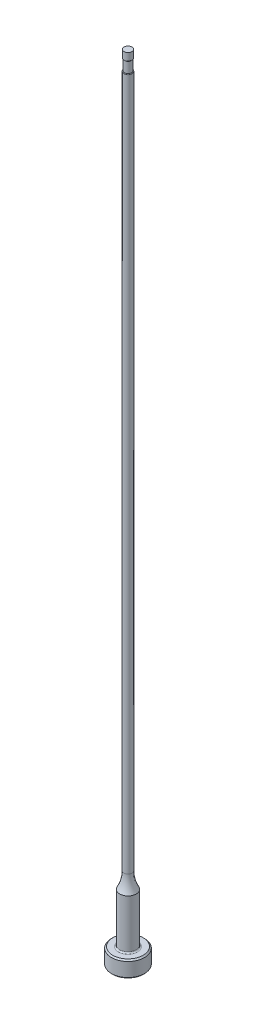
ISO-10303-21;
HEADER;
FILE_DESCRIPTION(('STEP AP214'),'2;1');
FILE_NAME('part.step','',(''),(''),'','','');
FILE_SCHEMA(('AUTOMOTIVE_DESIGN { 1 0 10303 214 1 1 1 1 }'));
ENDSEC;
DATA;
#1=APPLICATION_CONTEXT('core data for automotive mechanical design processes');
#2=APPLICATION_PROTOCOL_DEFINITION('international standard','automotive_design',2000,#1);
#3=PRODUCT_CONTEXT('',#1,'mechanical');
#4=PRODUCT('Part','Part','',(#3));
#5=PRODUCT_RELATED_PRODUCT_CATEGORY('part','',(#4));
#6=PRODUCT_DEFINITION_FORMATION('','',#4);
#7=PRODUCT_DEFINITION_CONTEXT('part definition',#1,'design');
#8=PRODUCT_DEFINITION('design','',#6,#7);
#9=PRODUCT_DEFINITION_SHAPE('','',#8);
#10=(LENGTH_UNIT() NAMED_UNIT(*) SI_UNIT(.MILLI.,.METRE.));
#11=(NAMED_UNIT(*) PLANE_ANGLE_UNIT() SI_UNIT($,.RADIAN.));
#12=(NAMED_UNIT(*) SI_UNIT($,.STERADIAN.) SOLID_ANGLE_UNIT());
#13=UNCERTAINTY_MEASURE_WITH_UNIT(LENGTH_MEASURE(1.E-05),#10,'distance_accuracy_value','');
#14=(GEOMETRIC_REPRESENTATION_CONTEXT(3) GLOBAL_UNCERTAINTY_ASSIGNED_CONTEXT((#13)) GLOBAL_UNIT_ASSIGNED_CONTEXT((#10,
#11,#12)) REPRESENTATION_CONTEXT('',''));
#15=CARTESIAN_POINT('',(0.,0.,0.));
#16=DIRECTION('',(0.,0.,1.));
#17=DIRECTION('',(1.,0.,0.));
#18=AXIS2_PLACEMENT_3D('',#15,#16,#17);
#19=CARTESIAN_POINT('',(0.,259.958771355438,0.));
#20=DIRECTION('',(0.,1.,0.));
#21=DIRECTION('',(0.,0.,1.));
#22=AXIS2_PLACEMENT_3D('',#19,#20,#21);
#23=CYLINDRICAL_SURFACE('',#22,0.79374999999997);
#24=DIRECTION('',(0.,1.,0.));
#25=VECTOR('',#24,1.);
#26=CARTESIAN_POINT('',(-0.692149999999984,259.958771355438,-0.388545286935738));
#27=LINE('',#26,#25);
#28=CARTESIAN_POINT('',(-0.692149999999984,148.719565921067,-0.388545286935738));
#29=VERTEX_POINT('',#28);
#30=CARTESIAN_POINT('',(-0.692149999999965,111.76,-0.388545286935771));
#31=VERTEX_POINT('',#30);
#32=EDGE_CURVE('E66',#29,#31,#27,.F.);
#33=ORIENTED_EDGE('',*,*,#32,.F.);
#34=CARTESIAN_POINT('',(0.,148.719565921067,0.));
#35=DIRECTION('',(0.,1.,0.));
#36=DIRECTION('',(0.,0.,1.));
#37=AXIS2_PLACEMENT_3D('',#34,#35,#36);
#38=CIRCLE('',#37,0.79374999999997);
#39=CARTESIAN_POINT('',(-0.692149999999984,148.719565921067,0.388545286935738));
#40=VERTEX_POINT('',#39);
#41=EDGE_CURVE('E44',#29,#40,#38,.F.);
#42=ORIENTED_EDGE('',*,*,#41,.T.);
#43=DIRECTION('',(0.,1.,0.));
#44=VECTOR('',#43,1.);
#45=CARTESIAN_POINT('',(-0.692149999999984,259.958771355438,0.388545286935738));
#46=LINE('',#45,#44);
#47=CARTESIAN_POINT('',(-0.692149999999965,111.76,0.388545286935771));
#48=VERTEX_POINT('',#47);
#49=EDGE_CURVE('E72',#48,#40,#46,.T.);
#50=ORIENTED_EDGE('',*,*,#49,.F.);
#51=CARTESIAN_POINT('',(-0.692149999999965,111.76,-0.388545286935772));
#52=CARTESIAN_POINT('',(-0.692147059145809,111.726595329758,-0.388529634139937));
#53=CARTESIAN_POINT('',(-0.692677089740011,111.693184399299,-0.387605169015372));
#54=CARTESIAN_POINT('',(-0.694785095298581,111.626441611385,-0.383825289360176));
#55=CARTESIAN_POINT('',(-0.696365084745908,111.593110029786,-0.380966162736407));
#56=CARTESIAN_POINT('',(-0.700560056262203,111.526665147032,-0.373193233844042));
#57=CARTESIAN_POINT('',(-0.703177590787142,111.493552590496,-0.368274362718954));
#58=CARTESIAN_POINT('',(-0.70939790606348,111.427866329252,-0.356147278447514));
#59=CARTESIAN_POINT('',(-0.712999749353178,111.395292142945,-0.348941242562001));
#60=CARTESIAN_POINT('',(-0.720516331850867,111.335629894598,-0.333107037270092));
#61=CARTESIAN_POINT('',(-0.724309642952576,111.308432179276,-0.324837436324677));
#62=CARTESIAN_POINT('',(-0.732469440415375,111.254890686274,-0.305996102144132));
#63=CARTESIAN_POINT('',(-0.736836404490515,111.228547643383,-0.295422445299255));
#64=CARTESIAN_POINT('',(-0.746025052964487,111.176994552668,-0.271391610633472));
#65=CARTESIAN_POINT('',(-0.75085027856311,111.151796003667,-0.257910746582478));
#66=CARTESIAN_POINT('',(-0.760636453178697,111.103650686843,-0.227438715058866));
#67=CARTESIAN_POINT('',(-0.765596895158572,111.080696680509,-0.210459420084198));
#68=CARTESIAN_POINT('',(-0.772863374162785,111.048559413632,-0.181185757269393));
#69=CARTESIAN_POINT('',(-0.775317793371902,111.037987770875,-0.170459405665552));
#70=CARTESIAN_POINT('',(-0.779981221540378,111.018302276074,-0.147661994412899));
#71=CARTESIAN_POINT('',(-0.782190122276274,111.009189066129,-0.135590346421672));
#72=CARTESIAN_POINT('',(-0.786212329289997,110.99284932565,-0.10990918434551));
#73=CARTESIAN_POINT('',(-0.788019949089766,110.985649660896,-0.0962812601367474));
#74=CARTESIAN_POINT('',(-0.790974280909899,110.973994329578,-0.0678329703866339));
#75=CARTESIAN_POINT('',(-0.792122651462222,110.969531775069,-0.0530157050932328));
#76=CARTESIAN_POINT('',(-0.793477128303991,110.964282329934,-0.0246588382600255));
#77=CARTESIAN_POINT('',(-0.793785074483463,110.963097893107,-0.0111986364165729));
#78=CARTESIAN_POINT('',(-0.793708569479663,110.963392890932,0.0156909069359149));
#79=CARTESIAN_POINT('',(-0.793324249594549,110.964871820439,0.0291202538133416));
#80=CARTESIAN_POINT('',(-0.792034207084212,110.969877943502,0.0533347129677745));
#81=CARTESIAN_POINT('',(-0.791220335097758,110.973045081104,0.064202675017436));
#82=CARTESIAN_POINT('',(-0.789221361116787,110.980900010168,0.0853309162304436));
#83=CARTESIAN_POINT('',(-0.78803617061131,110.985588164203,0.0955910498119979));
#84=CARTESIAN_POINT('',(-0.784691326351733,110.998986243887,0.120537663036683));
#85=CARTESIAN_POINT('',(-0.782345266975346,111.008520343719,0.134755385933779));
#86=CARTESIAN_POINT('',(-0.777271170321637,111.029662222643,0.161475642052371));
#87=CARTESIAN_POINT('',(-0.774542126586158,111.041275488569,0.173973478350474));
#88=CARTESIAN_POINT('',(-0.76709792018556,111.073902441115,0.204925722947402));
#89=CARTESIAN_POINT('',(-0.762235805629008,111.096152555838,0.222031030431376));
#90=CARTESIAN_POINT('',(-0.752599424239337,111.142926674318,0.252764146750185));
#91=CARTESIAN_POINT('',(-0.747825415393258,111.167456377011,0.26638290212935));
#92=CARTESIAN_POINT('',(-0.734693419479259,111.239796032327,0.30145019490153));
#93=CARTESIAN_POINT('',(-0.726816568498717,111.289351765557,0.319450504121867));
#94=CARTESIAN_POINT('',(-0.713277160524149,111.390727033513,0.348596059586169));
#95=CARTESIAN_POINT('',(-0.707621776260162,111.442553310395,0.359719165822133));
#96=CARTESIAN_POINT('',(-0.699557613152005,111.538820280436,0.375130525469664));
#97=CARTESIAN_POINT('',(-0.696772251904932,111.583103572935,0.380231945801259));
#98=CARTESIAN_POINT('',(-0.693072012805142,111.671601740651,0.386898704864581));
#99=CARTESIAN_POINT('',(-0.692139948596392,111.715813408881,0.388496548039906));
#100=CARTESIAN_POINT('',(-0.692149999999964,111.76,0.388545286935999));
#101=B_SPLINE_CURVE_WITH_KNOTS('',3,(#51,#52,#53,#54,#55,#56,#57,#58,#59,#60,#61,#62,#63,#64,
#65,#66,#67,#68,#69,#70,#71,#72,#73,#74,#75,#76,#77,#78,#79,#80,#81,#82,#83,#84,#85,#86,#87,#88,
#89,#90,#91,#92,#93,#94,#95,#96,#97,#98,#99,#100),.UNSPECIFIED.,.F.,.F.,(4,2,2,2,2,2,2,2,2,2,2,
2,2,2,2,2,2,2,2,2,2,2,2,2,4),(0.,0.100207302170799,0.20060742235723,0.30125608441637,
0.401809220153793,0.487757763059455,0.573778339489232,0.660528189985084,0.746988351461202,
0.792665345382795,0.838362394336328,0.884670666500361,0.930861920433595,0.971137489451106,
1.01140542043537,1.04531885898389,1.0792403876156,1.13077999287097,1.1824576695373,
1.26742509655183,1.35261096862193,1.51165072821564,1.67119985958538,1.80500866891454,
1.93757071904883),.UNSPECIFIED.);
#102=EDGE_CURVE('E74',#31,#48,#101,.T.);
#103=ORIENTED_EDGE('',*,*,#102,.F.);
#104=EDGE_LOOP('',(#33,#42,#50,#103));
#105=FACE_BOUND('',#104,.T.);
#106=CARTESIAN_POINT('',(0.,15.7741805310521,0.));
#107=DIRECTION('',(0.,1.,0.));
#108=DIRECTION('',(0.,0.,1.));
#109=AXIS2_PLACEMENT_3D('',#106,#107,#108);
#110=CIRCLE('',#109,0.79374999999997);
#111=CARTESIAN_POINT('',(0.,15.7741805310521,0.79374999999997));
#112=VERTEX_POINT('',#111);
#113=EDGE_CURVE('E95',#112,#112,#110,.T.);
#114=ORIENTED_EDGE('',*,*,#113,.T.);
#115=EDGE_LOOP('',(#114));
#116=FACE_BOUND('',#115,.T.);
#117=ADVANCED_FACE('F36',(#105,#116),#23,.T.);
#118=CARTESIAN_POINT('',(0.,15.7741805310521,0.));
#119=DIRECTION('',(0.,1.,0.));
#120=DIRECTION('',(0.,0.,1.));
#121=AXIS2_PLACEMENT_3D('',#118,#119,#120);
#122=TOROIDAL_SURFACE('',#121,7.14374999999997,6.35);
#123=CARTESIAN_POINT('',(0.,12.7,0.));
#124=DIRECTION('',(0.,1.,0.));
#125=DIRECTION('',(0.,0.,1.));
#126=AXIS2_PLACEMENT_3D('',#123,#124,#125);
#127=CIRCLE('',#126,1.58749999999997);
#128=CARTESIAN_POINT('',(0.,12.7,1.58749999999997));
#129=VERTEX_POINT('',#128);
#130=EDGE_CURVE('E92',#129,#129,#127,.T.);
#131=ORIENTED_EDGE('',*,*,#130,.T.);
#132=EDGE_LOOP('',(#131));
#133=FACE_BOUND('',#132,.T.);
#134=ORIENTED_EDGE('',*,*,#113,.F.);
#135=EDGE_LOOP('',(#134));
#136=FACE_BOUND('',#135,.T.);
#137=ADVANCED_FACE('F156',(#133,#136),#122,.F.);
#138=CARTESIAN_POINT('',(0.,259.958771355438,0.));
#139=DIRECTION('',(0.,1.,0.));
#140=DIRECTION('',(0.,0.,1.));
#141=AXIS2_PLACEMENT_3D('',#138,#139,#140);
#142=CYLINDRICAL_SURFACE('',#141,1.58749999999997);
#143=CARTESIAN_POINT('',(0.,3.42900000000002,0.));
#144=DIRECTION('',(0.,1.,0.));
#145=DIRECTION('',(0.,0.,1.));
#146=AXIS2_PLACEMENT_3D('',#143,#144,#145);
#147=CIRCLE('',#146,1.58749999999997);
#148=CARTESIAN_POINT('',(0.,3.42900000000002,1.58749999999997));
#149=VERTEX_POINT('',#148);
#150=EDGE_CURVE('E110',#149,#149,#147,.T.);
#151=ORIENTED_EDGE('',*,*,#150,.T.);
#152=EDGE_LOOP('',(#151));
#153=FACE_BOUND('',#152,.T.);
#154=ORIENTED_EDGE('',*,*,#130,.F.);
#155=EDGE_LOOP('',(#154));
#156=FACE_BOUND('',#155,.T.);
#157=ADVANCED_FACE('F153',(#153,#156),#142,.T.);
#158=CARTESIAN_POINT('',(-3.17499999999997,3.175,0.));
#159=DIRECTION('',(0.,1.,0.));
#160=DIRECTION('',(0.,0.,1.));
#161=AXIS2_PLACEMENT_3D('',#158,#159,#160);
#162=PLANE('',#161);
#163=CARTESIAN_POINT('',(0.,3.175,0.));
#164=DIRECTION('',(0.,1.,0.));
#165=DIRECTION('',(0.,0.,1.));
#166=AXIS2_PLACEMENT_3D('',#163,#164,#165);
#167=CIRCLE('',#166,1.84149999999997);
#168=CARTESIAN_POINT('',(0.,3.175,1.84149999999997));
#169=VERTEX_POINT('',#168);
#170=EDGE_CURVE('E78',#169,#169,#167,.F.);
#171=ORIENTED_EDGE('',*,*,#170,.T.);
#172=EDGE_LOOP('',(#171));
#173=FACE_BOUND('',#172,.T.);
#174=CARTESIAN_POINT('',(0.,3.175,0.));
#175=DIRECTION('',(0.,1.,0.));
#176=DIRECTION('',(0.,0.,1.));
#177=AXIS2_PLACEMENT_3D('',#174,#175,#176);
#178=CIRCLE('',#177,2.92099999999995);
#179=CARTESIAN_POINT('',(0.,3.175,2.92099999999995));
#180=VERTEX_POINT('',#179);
#181=EDGE_CURVE('E98',#180,#180,#178,.T.);
#182=ORIENTED_EDGE('',*,*,#181,.T.);
#183=EDGE_LOOP('',(#182));
#184=FACE_BOUND('',#183,.T.);
#185=ADVANCED_FACE('F149',(#173,#184),#162,.T.);
#186=CARTESIAN_POINT('',(0.,259.958771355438,0.));
#187=DIRECTION('',(0.,1.,0.));
#188=DIRECTION('',(0.,0.,1.));
#189=AXIS2_PLACEMENT_3D('',#186,#187,#188);
#190=CYLINDRICAL_SURFACE('',#189,3.17499999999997);
#191=CARTESIAN_POINT('',(0.,2.92100000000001,0.));
#192=DIRECTION('',(0.,1.,0.));
#193=DIRECTION('',(0.,0.,1.));
#194=AXIS2_PLACEMENT_3D('',#191,#192,#193);
#195=CIRCLE('',#194,3.17499999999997);
#196=CARTESIAN_POINT('',(0.,2.92100000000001,3.17499999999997));
#197=VERTEX_POINT('',#196);
#198=EDGE_CURVE('E104',#197,#197,#195,.F.);
#199=ORIENTED_EDGE('',*,*,#198,.T.);
#200=EDGE_LOOP('',(#199));
#201=FACE_BOUND('',#200,.T.);
#202=CARTESIAN_POINT('',(0.,0.254000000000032,0.));
#203=DIRECTION('',(0.,-1.,0.));
#204=DIRECTION('',(0.,0.,-1.));
#205=AXIS2_PLACEMENT_3D('',#202,#203,#204);
#206=CIRCLE('',#205,3.17499999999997);
#207=CARTESIAN_POINT('',(0.,0.254000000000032,-3.17499999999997));
#208=VERTEX_POINT('',#207);
#209=EDGE_CURVE('E101',#208,#208,#206,.F.);
#210=ORIENTED_EDGE('',*,*,#209,.T.);
#211=EDGE_LOOP('',(#210));
#212=FACE_BOUND('',#211,.T.);
#213=ADVANCED_FACE('F145',(#201,#212),#190,.T.);
#214=CARTESIAN_POINT('',(0.,0.,0.));
#215=DIRECTION('',(0.,-1.,0.));
#216=DIRECTION('',(0.,0.,-1.));
#217=AXIS2_PLACEMENT_3D('',#214,#215,#216);
#218=PLANE('',#217);
#219=CARTESIAN_POINT('',(0.,0.,0.));
#220=DIRECTION('',(0.,-1.,0.));
#221=DIRECTION('',(0.,0.,-1.));
#222=AXIS2_PLACEMENT_3D('',#219,#220,#221);
#223=CIRCLE('',#222,2.92099999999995);
#224=CARTESIAN_POINT('',(0.,0.,-2.92099999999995));
#225=VERTEX_POINT('',#224);
#226=EDGE_CURVE('E107',#225,#225,#223,.T.);
#227=ORIENTED_EDGE('',*,*,#226,.T.);
#228=EDGE_LOOP('',(#227));
#229=FACE_BOUND('',#228,.T.);
#230=ADVANCED_FACE('F141',(#229),#218,.T.);
#231=CARTESIAN_POINT('',(0.,3.17499999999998,0.));
#232=DIRECTION('',(0.,-1.,0.));
#233=DIRECTION('',(0.,0.,-1.));
#234=AXIS2_PLACEMENT_3D('',#231,#232,#233);
#235=CONICAL_SURFACE('',#234,2.92099999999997,0.7853981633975);
#236=ORIENTED_EDGE('',*,*,#198,.F.);
#237=EDGE_LOOP('',(#236));
#238=FACE_BOUND('',#237,.T.);
#239=ORIENTED_EDGE('',*,*,#181,.F.);
#240=EDGE_LOOP('',(#239));
#241=FACE_BOUND('',#240,.T.);
#242=ADVANCED_FACE('F144',(#238,#241),#235,.T.);
#243=CARTESIAN_POINT('',(0.,0.254000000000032,0.));
#244=DIRECTION('',(0.,1.,0.));
#245=DIRECTION('',(0.,0.,1.));
#246=AXIS2_PLACEMENT_3D('',#243,#244,#245);
#247=CONICAL_SURFACE('',#246,3.17499999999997,0.785398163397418);
#248=ORIENTED_EDGE('',*,*,#226,.F.);
#249=EDGE_LOOP('',(#248));
#250=FACE_BOUND('',#249,.T.);
#251=ORIENTED_EDGE('',*,*,#209,.F.);
#252=EDGE_LOOP('',(#251));
#253=FACE_BOUND('',#252,.T.);
#254=ADVANCED_FACE('F245',(#250,#253),#247,.T.);
#255=CARTESIAN_POINT('',(0.,3.42900000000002,0.));
#256=DIRECTION('',(0.,1.,0.));
#257=DIRECTION('',(0.,0.,1.));
#258=AXIS2_PLACEMENT_3D('',#255,#256,#257);
#259=TOROIDAL_SURFACE('',#258,1.84149999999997,0.254);
#260=ORIENTED_EDGE('',*,*,#170,.F.);
#261=EDGE_LOOP('',(#260));
#262=FACE_BOUND('',#261,.T.);
#263=ORIENTED_EDGE('',*,*,#150,.F.);
#264=EDGE_LOOP('',(#263));
#265=FACE_BOUND('',#264,.T.);
#266=ADVANCED_FACE('F139',(#262,#265),#259,.F.);
#267=CARTESIAN_POINT('',(0.,153.448281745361,0.));
#268=DIRECTION('',(0.,1.,0.));
#269=DIRECTION('',(0.,0.,1.));
#270=AXIS2_PLACEMENT_3D('',#267,#268,#269);
#271=CYLINDRICAL_SURFACE('',#270,0.69214999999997);
#272=CARTESIAN_POINT('',(0.,150.876,0.));
#273=DIRECTION('',(0.,1.,0.));
#274=DIRECTION('',(0.,0.,1.));
#275=AXIS2_PLACEMENT_3D('',#272,#273,#274);
#276=CIRCLE('',#275,0.69214999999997);
#277=CARTESIAN_POINT('',(0.,150.876,0.69214999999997));
#278=VERTEX_POINT('',#277);
#279=EDGE_CURVE('E71',#278,#278,#276,.T.);
#280=ORIENTED_EDGE('',*,*,#279,.F.);
#281=EDGE_LOOP('',(#280));
#282=FACE_BOUND('',#281,.T.);
#283=CARTESIAN_POINT('',(0.,148.844,0.));
#284=DIRECTION('',(0.,1.,0.));
#285=DIRECTION('',(0.,0.,1.));
#286=AXIS2_PLACEMENT_3D('',#283,#284,#285);
#287=CIRCLE('',#286,0.69214999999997);
#288=CARTESIAN_POINT('',(-0.69214999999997,148.844,0.));
#289=VERTEX_POINT('',#288);
#290=EDGE_CURVE('E89',#289,#289,#287,.T.);
#291=ORIENTED_EDGE('',*,*,#290,.T.);
#292=EDGE_LOOP('',(#291));
#293=FACE_BOUND('',#292,.T.);
#294=ADVANCED_FACE('F136',(#282,#293),#271,.T.);
#295=CARTESIAN_POINT('',(-0.69214999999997,149.86,-3.17499999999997));
#296=DIRECTION('',(1.,0.,0.));
#297=DIRECTION('',(0.,1.,0.));
#298=AXIS2_PLACEMENT_3D('',#295,#296,#297);
#299=PLANE('',#298);
#300=CARTESIAN_POINT('',(-0.692149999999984,148.719565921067,0.388545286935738));
#301=CARTESIAN_POINT('',(-0.692149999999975,148.723289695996,0.388553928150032));
#302=CARTESIAN_POINT('',(-0.692149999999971,148.727004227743,0.388211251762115));
#303=CARTESIAN_POINT('',(-0.692149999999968,148.734289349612,0.386898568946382));
#304=CARTESIAN_POINT('',(-0.692149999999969,148.737860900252,0.38593396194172));
#305=CARTESIAN_POINT('',(-0.69214999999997,148.744791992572,0.383453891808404));
#306=CARTESIAN_POINT('',(-0.69214999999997,148.74815209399,0.381939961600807));
#307=CARTESIAN_POINT('',(-0.69214999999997,148.75463226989,0.378456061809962));
#308=CARTESIAN_POINT('',(-0.69214999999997,148.757751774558,0.376485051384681));
#309=CARTESIAN_POINT('',(-0.69214999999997,148.76566563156,0.370784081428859));
#310=CARTESIAN_POINT('',(-0.69214999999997,148.770235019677,0.366742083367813));
#311=CARTESIAN_POINT('',(-0.69214999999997,148.778692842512,0.358002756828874));
#312=CARTESIAN_POINT('',(-0.69214999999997,148.782579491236,0.353303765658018));
#313=CARTESIAN_POINT('',(-0.69214999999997,148.792363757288,0.339903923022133));
#314=CARTESIAN_POINT('',(-0.69214999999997,148.797670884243,0.330775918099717));
#315=CARTESIAN_POINT('',(-0.69214999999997,148.806938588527,0.311873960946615));
#316=CARTESIAN_POINT('',(-0.69214999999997,148.810895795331,0.302098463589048));
#317=CARTESIAN_POINT('',(-0.69214999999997,148.81935470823,0.277716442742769));
#318=CARTESIAN_POINT('',(-0.69214999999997,148.82329702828,0.262919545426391));
#319=CARTESIAN_POINT('',(-0.69214999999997,148.829750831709,0.233007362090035));
#320=CARTESIAN_POINT('',(-0.69214999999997,148.832258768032,0.217891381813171));
#321=CARTESIAN_POINT('',(-0.69214999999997,148.838375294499,0.172181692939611));
#322=CARTESIAN_POINT('',(-0.69214999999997,148.840529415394,0.141404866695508));
#323=CARTESIAN_POINT('',(-0.69214999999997,148.842692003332,0.0920701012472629));
#324=CARTESIAN_POINT('',(-0.69214999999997,148.843212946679,0.0735164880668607));
#325=CARTESIAN_POINT('',(-0.69214999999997,148.843853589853,0.0366435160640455));
#326=CARTESIAN_POINT('',(-0.69214999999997,148.843978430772,0.0183242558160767));
#327=CARTESIAN_POINT('',(-0.69214999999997,148.844,0.));
#328=B_SPLINE_CURVE_WITH_KNOTS('',3,(#300,#301,#302,#303,#304,#305,#306,#307,#308,#309,#310,
#311,#312,#313,#314,#315,#316,#317,#318,#319,#320,#321,#322,#323,#324,#325,#326,#327),
.UNSPECIFIED.,.F.,.F.,(4,2,2,2,2,2,2,2,2,2,2,2,2,4),(0.,0.0111408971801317,0.0221863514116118,
0.0332012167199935,0.0442414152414,0.0624374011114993,0.0806802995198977,0.112177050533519,
0.143751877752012,0.189567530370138,0.235495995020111,0.327902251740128,0.383589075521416,
0.438550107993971),.UNSPECIFIED.);
#329=EDGE_CURVE('E77',#40,#289,#328,.T.);
#330=ORIENTED_EDGE('',*,*,#329,.T.);
#331=CARTESIAN_POINT('',(-0.69214999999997,148.844,0.));
#332=CARTESIAN_POINT('',(-0.69214999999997,148.843997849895,-0.0105245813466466));
#333=CARTESIAN_POINT('',(-0.69214999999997,148.843951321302,-0.0210488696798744));
#334=CARTESIAN_POINT('',(-0.69214999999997,148.84375049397,-0.0420982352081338));
#335=CARTESIAN_POINT('',(-0.69214999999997,148.843596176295,-0.0526233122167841));
#336=CARTESIAN_POINT('',(-0.69214999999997,148.842939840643,-0.0843503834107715));
#337=CARTESIAN_POINT('',(-0.69214999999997,148.842243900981,-0.105550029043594));
#338=CARTESIAN_POINT('',(-0.69214999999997,148.839914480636,-0.148128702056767));
#339=CARTESIAN_POINT('',(-0.69214999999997,148.838271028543,-0.169507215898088));
#340=CARTESIAN_POINT('',(-0.69214999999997,148.833296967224,-0.212034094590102));
#341=CARTESIAN_POINT('',(-0.69214999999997,148.82997232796,-0.233183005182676));
#342=CARTESIAN_POINT('',(-0.69214999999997,148.823208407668,-0.262553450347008));
#343=CARTESIAN_POINT('',(-0.69214999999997,148.820990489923,-0.27105086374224));
#344=CARTESIAN_POINT('',(-0.69214999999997,148.815911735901,-0.287887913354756));
#345=CARTESIAN_POINT('',(-0.69214999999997,148.813048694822,-0.296226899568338));
#346=CARTESIAN_POINT('',(-0.69214999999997,148.805703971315,-0.314648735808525));
#347=CARTESIAN_POINT('',(-0.69214999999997,148.800996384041,-0.324643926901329));
#348=CARTESIAN_POINT('',(-0.69214999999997,148.789902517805,-0.343648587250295));
#349=CARTESIAN_POINT('',(-0.69214999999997,148.783528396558,-0.352664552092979));
#350=CARTESIAN_POINT('',(-0.69214999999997,148.773016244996,-0.363960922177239));
#351=CARTESIAN_POINT('',(-0.69214999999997,148.769779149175,-0.367075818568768));
#352=CARTESIAN_POINT('',(-0.69214999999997,148.762910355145,-0.372849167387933));
#353=CARTESIAN_POINT('',(-0.69214999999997,148.759278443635,-0.375507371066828));
#354=CARTESIAN_POINT('',(-0.69214999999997,148.751582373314,-0.380238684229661));
#355=CARTESIAN_POINT('',(-0.69214999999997,148.74751340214,-0.382304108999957));
#356=CARTESIAN_POINT('',(-0.69214999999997,148.739058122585,-0.385614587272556));
#357=CARTESIAN_POINT('',(-0.69214999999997,148.734672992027,-0.386862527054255));
#358=CARTESIAN_POINT('',(-0.69214999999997,148.728454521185,-0.387934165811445));
#359=CARTESIAN_POINT('',(-0.69214999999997,148.726685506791,-0.388162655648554));
#360=CARTESIAN_POINT('',(-0.69214999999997,148.723133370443,-0.388468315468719));
#361=CARTESIAN_POINT('',(-0.69214999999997,148.7213502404,-0.388545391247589));
#362=CARTESIAN_POINT('',(-0.69214999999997,148.719565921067,-0.388545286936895));
#363=B_SPLINE_CURVE_WITH_KNOTS('',3,(#331,#332,#333,#334,#335,#336,#337,#338,#339,#340,#341,
#342,#343,#344,#345,#346,#347,#348,#349,#350,#351,#352,#353,#354,#355,#356,#357,#358,#359,#360,
#361,#362),.UNSPECIFIED.,.F.,.F.,(4,2,2,2,2,2,2,2,2,2,2,2,2,2,2,4),(0.,0.0315729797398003,
0.0631515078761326,0.126771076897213,0.191072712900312,0.255147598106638,0.281475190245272,
0.307894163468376,0.340944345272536,0.373759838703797,0.387205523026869,0.40065850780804,
0.414278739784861,0.427850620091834,0.433196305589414,0.438545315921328),.UNSPECIFIED.);
#364=EDGE_CURVE('E58',#289,#29,#363,.T.);
#365=ORIENTED_EDGE('',*,*,#364,.T.);
#366=ORIENTED_EDGE('',*,*,#32,.T.);
#367=DIRECTION('',(0.,0.,1.));
#368=VECTOR('',#367,1.);
#369=CARTESIAN_POINT('',(-0.692149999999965,111.76,-3.17499999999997));
#370=LINE('',#369,#368);
#371=EDGE_CURVE('E70',#31,#48,#370,.T.);
#372=ORIENTED_EDGE('',*,*,#371,.T.);
#373=ORIENTED_EDGE('',*,*,#49,.T.);
#374=EDGE_LOOP('',(#330,#365,#366,#372,#373));
#375=FACE_BOUND('',#374,.T.);
#376=ADVANCED_FACE('F68',(#375),#299,.F.);
#377=CARTESIAN_POINT('',(-3.86714999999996,111.76,-3.17499999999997));
#378=DIRECTION('',(0.,0.,1.));
#379=DIRECTION('',(1.,0.,0.));
#380=AXIS2_PLACEMENT_3D('',#377,#378,#379);
#381=CYLINDRICAL_SURFACE('',#380,3.175);
#382=ORIENTED_EDGE('',*,*,#371,.F.);
#383=ORIENTED_EDGE('',*,*,#102,.T.);
#384=EDGE_LOOP('',(#382,#383));
#385=FACE_BOUND('',#384,.T.);
#386=ADVANCED_FACE('F80',(#385),#381,.F.);
#387=CARTESIAN_POINT('',(0.,152.687735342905,0.));
#388=DIRECTION('',(0.,1.,0.));
#389=DIRECTION('',(0.,0.,1.));
#390=AXIS2_PLACEMENT_3D('',#387,#388,#389);
#391=CYLINDRICAL_SURFACE('',#390,0.76834999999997);
#392=CARTESIAN_POINT('',(0.,150.992397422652,0.));
#393=DIRECTION('',(0.,-1.,0.));
#394=DIRECTION('',(0.,0.,-1.));
#395=AXIS2_PLACEMENT_3D('',#392,#393,#394);
#396=CIRCLE('',#395,0.76834999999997);
#397=CARTESIAN_POINT('',(0.,150.992397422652,-0.76834999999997));
#398=VERTEX_POINT('',#397);
#399=EDGE_CURVE('E11',#398,#398,#396,.F.);
#400=ORIENTED_EDGE('',*,*,#399,.T.);
#401=EDGE_LOOP('',(#400));
#402=FACE_BOUND('',#401,.T.);
#403=CARTESIAN_POINT('',(0.,152.4,0.));
#404=DIRECTION('',(0.,1.,0.));
#405=DIRECTION('',(0.,0.,1.));
#406=AXIS2_PLACEMENT_3D('',#403,#404,#405);
#407=CIRCLE('',#406,0.76834999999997);
#408=CARTESIAN_POINT('',(0.,152.4,0.76834999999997));
#409=VERTEX_POINT('',#408);
#410=EDGE_CURVE('E81',#409,#409,#407,.T.);
#411=ORIENTED_EDGE('',*,*,#410,.F.);
#412=EDGE_LOOP('',(#411));
#413=FACE_BOUND('',#412,.T.);
#414=ADVANCED_FACE('F133',(#402,#413),#391,.T.);
#415=CARTESIAN_POINT('',(-0.79374999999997,152.4,0.));
#416=DIRECTION('',(0.,1.,0.));
#417=DIRECTION('',(0.,0.,1.));
#418=AXIS2_PLACEMENT_3D('',#415,#416,#417);
#419=PLANE('',#418);
#420=ORIENTED_EDGE('',*,*,#410,.T.);
#421=EDGE_LOOP('',(#420));
#422=FACE_BOUND('',#421,.T.);
#423=ADVANCED_FACE('F177',(#422),#419,.T.);
#424=CARTESIAN_POINT('',(0.,148.719565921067,0.));
#425=DIRECTION('',(0.,1.,0.));
#426=DIRECTION('',(0.,0.,1.));
#427=AXIS2_PLACEMENT_3D('',#424,#425,#426);
#428=TOROIDAL_SURFACE('',#427,0.66674999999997,0.127);
#429=ORIENTED_EDGE('',*,*,#329,.F.);
#430=ORIENTED_EDGE('',*,*,#41,.F.);
#431=ORIENTED_EDGE('',*,*,#364,.F.);
#432=ORIENTED_EDGE('',*,*,#290,.F.);
#433=EDGE_LOOP('',(#429,#430,#431,#432));
#434=FACE_BOUND('',#433,.T.);
#435=ADVANCED_FACE('F209',(#434),#428,.T.);
#436=CARTESIAN_POINT('',(0.,150.992397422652,0.));
#437=DIRECTION('',(0.,-1.,0.));
#438=DIRECTION('',(0.,0.,-1.));
#439=AXIS2_PLACEMENT_3D('',#436,#437,#438);
#440=TOROIDAL_SURFACE('',#439,0.64134999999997,0.127);
#441=ORIENTED_EDGE('',*,*,#279,.T.);
#442=EDGE_LOOP('',(#441));
#443=FACE_BOUND('',#442,.T.);
#444=ORIENTED_EDGE('',*,*,#399,.F.);
#445=EDGE_LOOP('',(#444));
#446=FACE_BOUND('',#445,.T.);
#447=ADVANCED_FACE('F38',(#443,#446),#440,.T.);
#448=CLOSED_SHELL('',(#117,#137,#157,#185,#213,#230,#242,#254,#266,#294,#376,#386,#414,#423,
#435,#447));
#449=MANIFOLD_SOLID_BREP('B2',#448);
#450=ADVANCED_BREP_SHAPE_REPRESENTATION('',(#18,#449),#14);
#451=SHAPE_DEFINITION_REPRESENTATION(#9,#450);
ENDSEC;
END-ISO-10303-21;
